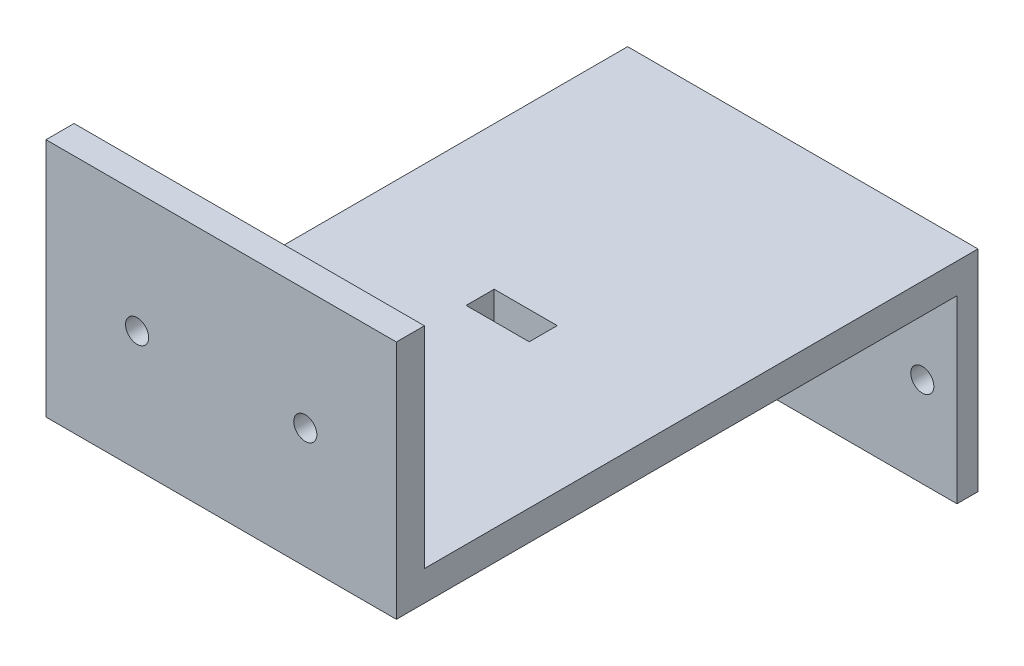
from build123d import *

# Parameters (mm, degrees)
SKETCH_1_W          = 50
SKETCH_1_H          = 30
EXTRUDE_1_DEPTH     = 3
SKETCH_3_W          = 50
SKETCH_3_H          = 4.282662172
EXTRUDE_2_DEPTH     = 80
SKETCH_6_W          = 50
SKETCH_6_H          = 4
EXTRUDE_3_DEPTH     = 30
SKETCH_7_R          = 1.65
CUT_EXTRUDE_1_DEPTH = 30
SKETCH_8_R          = 1.65
CUT_EXTRUDE_2_DEPTH = 30
SKETCH_9_W          = 9
SKETCH_9_H          = 4
CUT_EXTRUDE_3_DEPTH = 10


with BuildPart() as part:
    # Sketch 1 → Extrude 1 (new body)
    with BuildSketch(Plane.XY):
        with Locations((-25, 15)):
            Rectangle(SKETCH_1_W, SKETCH_1_H)
    extrude(amount=EXTRUDE_1_DEPTH)

    # Sketch 3 → Extrude 2 (add)
    with BuildSketch(Plane.XY.offset(3)):
        with Locations((-25, 27.858668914)):
            Rectangle(SKETCH_3_W, SKETCH_3_H)
    extrude(amount=EXTRUDE_2_DEPTH)

    # Sketch 6 → Extrude 3 (add)
    with BuildSketch(Plane(origin=(0, 30, 0), x_dir=(1, 0, 0), z_dir=(0, 1, 0))):
        with Locations((-25, -81)):
            Rectangle(SKETCH_6_W, SKETCH_6_H)
    extrude(amount=EXTRUDE_3_DEPTH)

    # Sketch 7 → Cut-Extrude 1 (cut)
    with BuildSketch(Plane.XY.offset(3)):
        with Locations((-45.05, 12.858668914)):
            Circle(SKETCH_7_R)
        with Locations(Location((-4.95, 12.858668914, 0), (0, 0, 180))):
            Circle(SKETCH_7_R)
    extrude(amount=-CUT_EXTRUDE_1_DEPTH, mode=Mode.SUBTRACT)

    # Sketch 8 → Cut-Extrude 2 (cut)
    with BuildSketch(Plane.XY.offset(83)):
        with Locations((-37, 42.858668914)):
            Circle(SKETCH_8_R)
        with Locations((-13, 42.858668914)):
            Circle(SKETCH_8_R)
    extrude(amount=-CUT_EXTRUDE_2_DEPTH, mode=Mode.SUBTRACT)

    # Sketch 9 → Cut-Extrude 3 (cut)
    with BuildSketch(Plane.XZ.offset(-25.717337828)):
        with Locations((-25.043854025, 41.5)):
            Rectangle(SKETCH_9_W, SKETCH_9_H)
        with Locations((-25.043854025, 72.338050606)):
            Rectangle(SKETCH_9_W, SKETCH_9_H)
    extrude(amount=-CUT_EXTRUDE_3_DEPTH, mode=Mode.SUBTRACT)


solid = part.part
